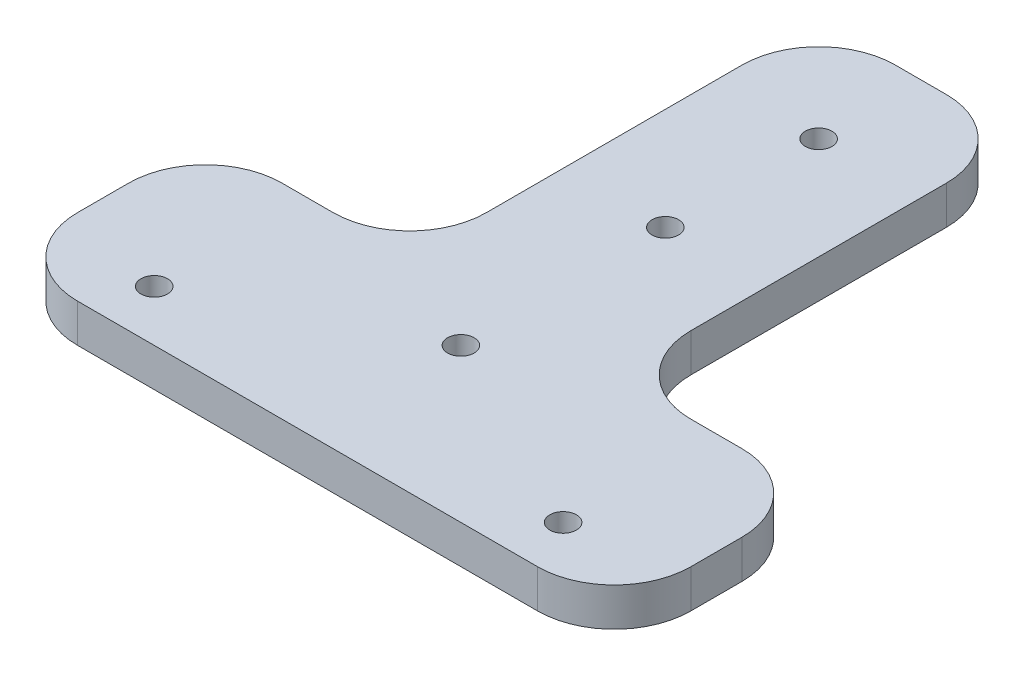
from build123d import *

# Parameters (mm, degrees)
BOSS_EXTRUDE1_DEPTH = 9.525
SKETCH2_R           = 3.302
HOLES_DEPTH         = 171.65440406
FILLET1_R           = 19.05


with BuildPart() as part:
    # Sketch1 → Boss-Extrude1 (new body)
    with BuildSketch(Plane(origin=(0, 0, 0), x_dir=(1, 0, 0), z_dir=(0, 1, 0))):
        Polygon((0, 0), (76.2, 0), (76.2, 50.8), (25.4, 50.8), (25.4, 152.4), (-25.4, 152.4), (-25.4, 50.8), (-76.2, 50.8), (-76.2, 0), align=None)
    extrude(amount=BOSS_EXTRUDE1_DEPTH)

    # Sketch2 → holes (cut, through all)
    with BuildSketch(Plane(origin=(0, 9.525, 0), x_dir=(1, 0, 0), z_dir=(0, 1, 0))):
        with Locations(Location((0, 127, 0), (0, 0, 270))):
            Circle(SKETCH2_R)
        with Locations(Location((0, 88.9, 0), (0, 0, 270))):
            Circle(SKETCH2_R)
        with Locations(Location((-50.8, 12.7, 0), (0, 0, 270))):
            Circle(SKETCH2_R)
        with Locations(Location((0, 38.1, 0), (0, 0, 270))):
            Circle(SKETCH2_R)
        with Locations(Location((50.8, 12.7, 0), (0, 0, 270))):
            Circle(SKETCH2_R)
    extrude(amount=-HOLES_DEPTH, mode=Mode.SUBTRACT)

    # Fillet1
    fillet1_edges = [part.edges().sort_by_distance(p)[0] for p in [
        (-76.2, 4.7625, 0),
        (-76.2, 4.7625, -50.8),
        (-25.4, 4.7625, -50.8),
        (-25.4, 4.7625, -152.4),
        (25.4, 4.7625, -152.4),
        (25.4, 4.7625, -50.8),
        (76.2, 4.7625, -50.8),
        (76.2, 4.7625, 0),
    ]]
    fillet(fillet1_edges, radius=FILLET1_R)


solid = part.part
